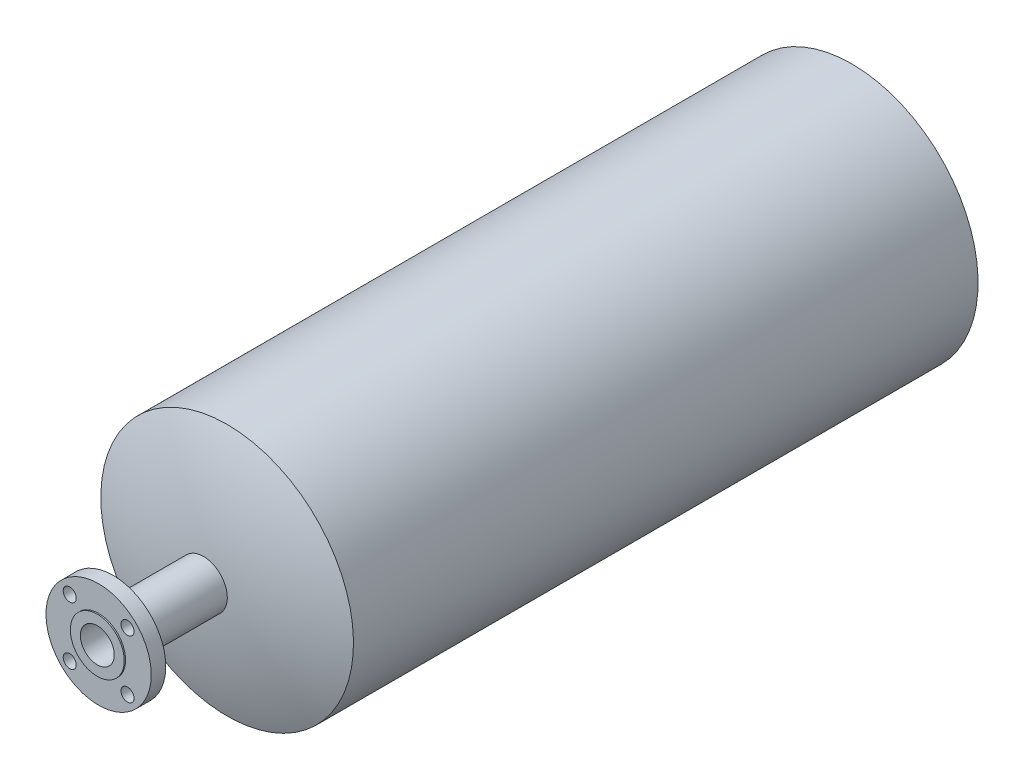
from build123d import *

# Parameters (mm, degrees)
BOLT_HOLE_REACH           = 1068.007
BOLT_CIRCLE_SKETCH_R      = 7.874
BOLT_CIRCLE_PATTERN_COUNT = 4


with BuildPart() as part:
    # Sketch3 → Revolve1 (revolve)
    with BuildSketch(Plane(origin=(0, 0, 0), x_dir=(0, 0, -1), z_dir=(1, 0, 0))):
        with BuildLine():
            Line((783.142883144, 152.4), (29.657116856, 152.4))
            ThreePointArc((29.657116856, 152.4), (7.483174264, 77.629415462), (0, 0))
            Line((0, 0), (812.8, 0))
            ThreePointArc((812.8, 0), (805.316825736, 77.629415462), (783.142883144, 152.4))
        make_face()
    revolve(axis=Axis((0, 0, -812.8), (0, 0, 1)))

    # Nozzle_sketch → Nozzle_Body (revolve)
    with BuildSketch(Plane(origin=(0, -361.95, 254), x_dir=(0, 0, -1), z_dir=(1, 0, 0)), mode=Mode.PRIVATE) as nozzle_body_sk:
        Polygon((127, 341.503), (127, 329.438), (128.5875, 329.438), (128.5875, 298.45), (146.1135, 298.45), (146.1135, 333.121), (279.4, 333.121), (279.4, 341.503), align=None)
    revolve(nozzle_body_sk.sketch.rotate(Axis((0, 0, -25.4), (0, 0, 1)), 180), axis=Axis((0, 0, -25.4), (0, 0, 1)))

    # Bolt_circle_sketch → Bolt_hole (cut, up to next)
    with BuildSketch(Plane(origin=(0, 330.2, 125.4125), x_dir=(-1, 0, 0), z_dir=(0, 0, 1)), mode=Mode.PRIVATE) as bolt_hole_sk1:
        with Locations(Location((34.84339375, 365.04339375, 0), (0, 0, 180))):
            Circle(BOLT_CIRCLE_SKETCH_R)
    bolt_hole_tool1 = extrude(bolt_hole_sk1.sketch, amount=-BOLT_HOLE_REACH, mode=Mode.PRIVATE) & part.part
    bolt_hole = bolt_hole_tool1.solids().sort_by_distance((-34.843394, -34.843394, 125.4125))[0]
    add(bolt_hole, mode=Mode.SUBTRACT)

    # Bolt_Circle_Pattern: Bolt_hole ×4 about axis
    bolt_circle_pattern_axis = Axis((0, 0, 0), (0, 0, 1))
    for i in range(1, BOLT_CIRCLE_PATTERN_COUNT):
        add(bolt_hole.rotate(bolt_circle_pattern_axis, i * 360 / BOLT_CIRCLE_PATTERN_COUNT), mode=Mode.SUBTRACT)


solid = part.part
